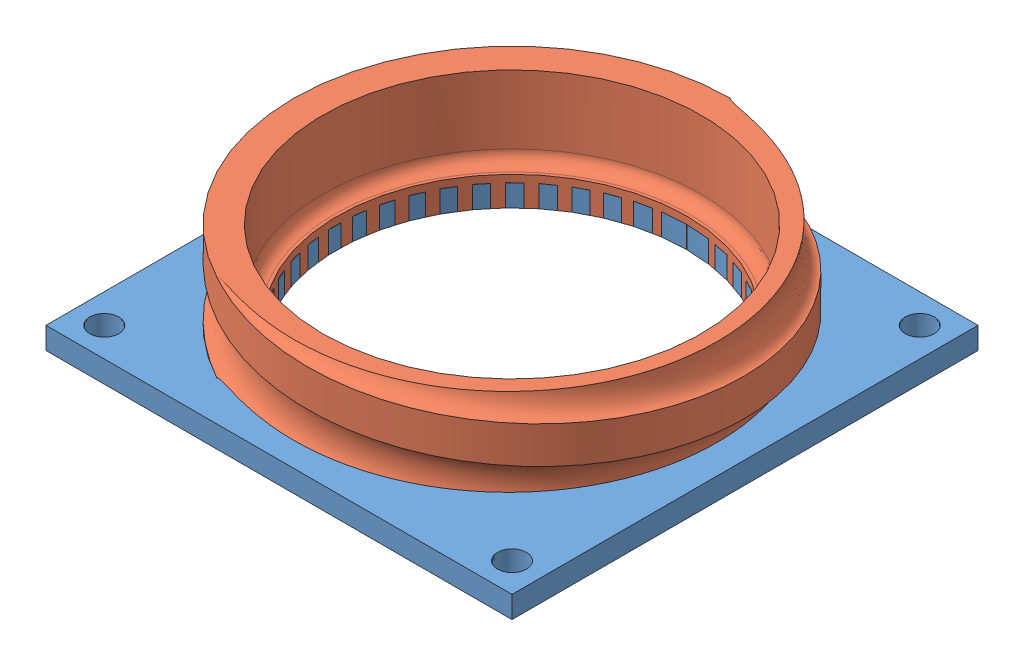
SolidWorks assembly LED_plate.SLDASM, configuration Default (file format 11000). Lengths in mm.
Overall size (101.6 106.43 101.6).
2 component instances, 2 part files, 1 mates.
Components (placement in the parent):
- LED_square-2: LED_square.SLDPRT [Default] at (15.3374 -7.2773 101.6) size (101.6 4.76 101.6)
- LED cylinder-2: LED cylinder.SLDPRT [Default] at (15.3374 -2.5148 101.6) size (95.92 106.43 95.87)
Mates (geometry in assembly coordinates):
- ProfileCenter3: profile center: plane of LED_square-2 through (15.3374 -2.5148 101.6) normal (0 1 0); circle of LED cylinder-2
